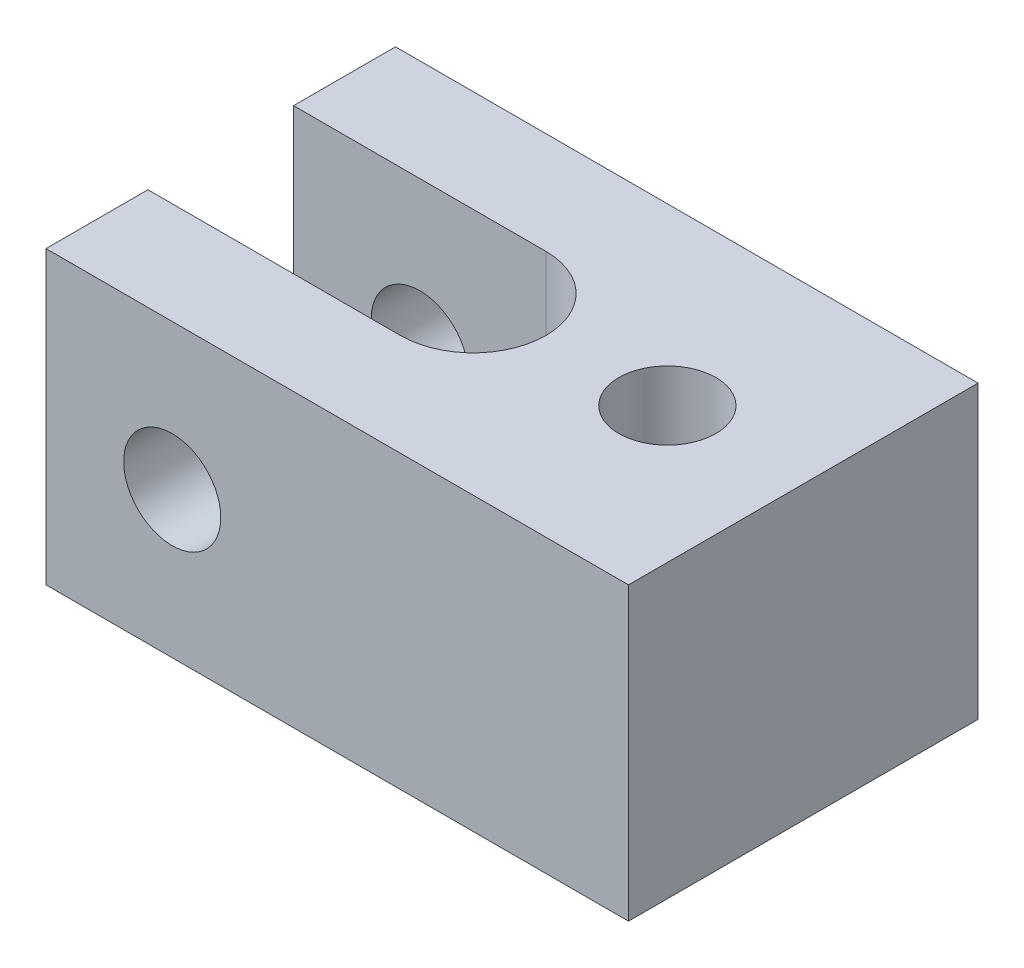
from build123d import *

# Parameters (mm, degrees)
SKETCH1_W           = 38.1
SKETCH1_H           = 19.05
SKETCH1_R           = 3.175
BOSS_EXTRUDE1_DEPTH = 22.86
SKETCH2_R           = 3.175
CUT_EXTRUDE1_DEPTH  = 49.343480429


with BuildPart() as part:
    # Sketch1 → Boss-Extrude1 (new body)
    with BuildSketch(Plane.XY):
        with Locations((19.05, 9.525)):
            Rectangle(SKETCH1_W, SKETCH1_H)
        with Locations((8.255, 9.525)):
            Circle(SKETCH1_R, mode=Mode.SUBTRACT)
    extrude(amount=BOSS_EXTRUDE1_DEPTH)

    # Sketch2 → Cut-Extrude1 (cut, through all)
    with BuildSketch(Plane.XZ):
        with Locations(Location((29.21, 11.43, 0), (0, 0, 270))):
            Circle(SKETCH2_R)
        with BuildLine():
            Line((0, 16.1925), (16.51, 16.1925))
            ThreePointArc((16.51, 16.1925), (21.2725, 11.43), (16.51, 6.6675))
            Line((16.51, 6.6675), (0, 6.6675))
            Line((0, 6.6675), (0, 16.1925))
        make_face()
    extrude(amount=-CUT_EXTRUDE1_DEPTH, mode=Mode.SUBTRACT)


solid = part.part
